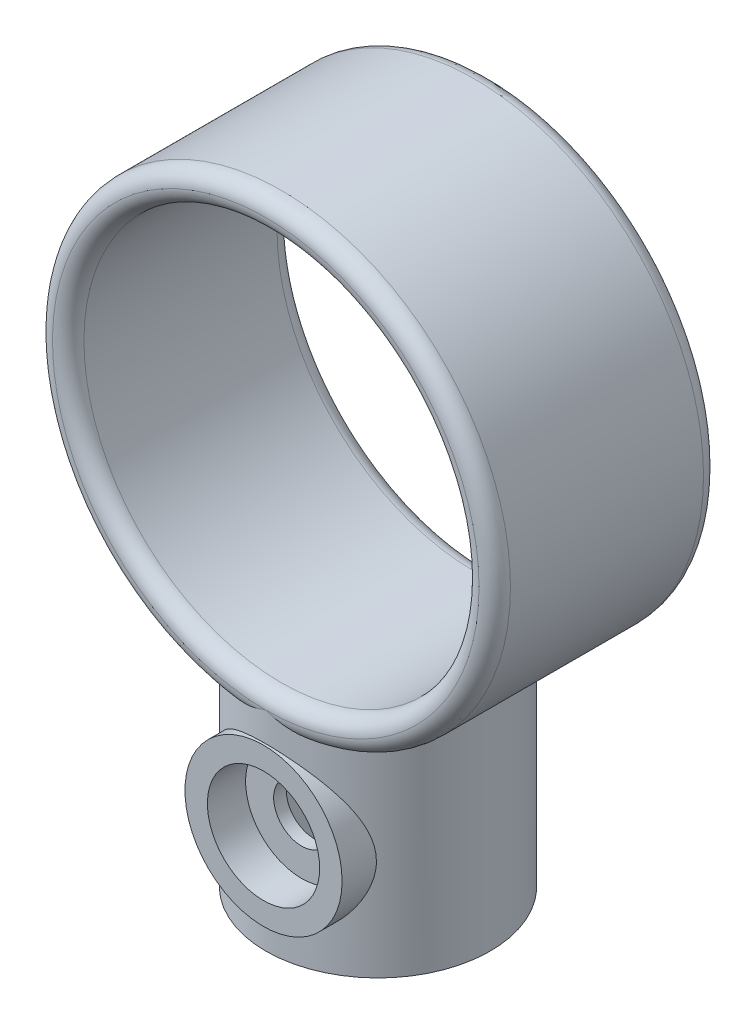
ISO-10303-21;
HEADER;
FILE_DESCRIPTION(('STEP AP214'),'2;1');
FILE_NAME('part.step','',(''),(''),'','','');
FILE_SCHEMA(('AUTOMOTIVE_DESIGN { 1 0 10303 214 1 1 1 1 }'));
ENDSEC;
DATA;
#1=APPLICATION_CONTEXT('core data for automotive mechanical design processes');
#2=APPLICATION_PROTOCOL_DEFINITION('international standard','automotive_design',2000,#1);
#3=PRODUCT_CONTEXT('',#1,'mechanical');
#4=PRODUCT('Part','Part','',(#3));
#5=PRODUCT_RELATED_PRODUCT_CATEGORY('part','',(#4));
#6=PRODUCT_DEFINITION_FORMATION('','',#4);
#7=PRODUCT_DEFINITION_CONTEXT('part definition',#1,'design');
#8=PRODUCT_DEFINITION('design','',#6,#7);
#9=PRODUCT_DEFINITION_SHAPE('','',#8);
#10=(LENGTH_UNIT() NAMED_UNIT(*) SI_UNIT(.MILLI.,.METRE.));
#11=(NAMED_UNIT(*) PLANE_ANGLE_UNIT() SI_UNIT($,.RADIAN.));
#12=(NAMED_UNIT(*) SI_UNIT($,.STERADIAN.) SOLID_ANGLE_UNIT());
#13=UNCERTAINTY_MEASURE_WITH_UNIT(LENGTH_MEASURE(1.E-05),#10,'distance_accuracy_value','');
#14=(GEOMETRIC_REPRESENTATION_CONTEXT(3) GLOBAL_UNCERTAINTY_ASSIGNED_CONTEXT((#13)) GLOBAL_UNIT_ASSIGNED_CONTEXT((#10,
#11,#12)) REPRESENTATION_CONTEXT('',''));
#15=CARTESIAN_POINT('',(0.,0.,0.));
#16=DIRECTION('',(0.,0.,1.));
#17=DIRECTION('',(1.,0.,0.));
#18=AXIS2_PLACEMENT_3D('',#15,#16,#17);
#19=CARTESIAN_POINT('',(-1.5875,-13.081,3.60275071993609));
#20=DIRECTION('',(0.,0.,-1.));
#21=DIRECTION('',(-1.,0.,0.));
#22=AXIS2_PLACEMENT_3D('',#19,#20,#21);
#23=PLANE('',#22);
#24=CARTESIAN_POINT('',(0.,-18.161,3.60275071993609));
#25=DIRECTION('',(0.,0.,-1.));
#26=DIRECTION('',(-1.,0.,0.));
#27=AXIS2_PLACEMENT_3D('',#24,#25,#26);
#28=CIRCLE('',#27,1.5875);
#29=CARTESIAN_POINT('',(1.5875,-18.161,3.60275071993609));
#30=VERTEX_POINT('',#29);
#31=CARTESIAN_POINT('',(-1.5875,-18.161,3.60275071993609));
#32=VERTEX_POINT('',#31);
#33=EDGE_CURVE('E47',#30,#32,#28,.F.);
#34=ORIENTED_EDGE('',*,*,#33,.T.);
#35=DIRECTION('',(0.,-1.,0.));
#36=VECTOR('',#35,1.);
#37=CARTESIAN_POINT('',(-1.5875,-13.081,3.60275071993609));
#38=LINE('',#37,#36);
#39=CARTESIAN_POINT('',(-1.5875,-13.081,3.60275071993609));
#40=VERTEX_POINT('',#39);
#41=EDGE_CURVE('E93',#40,#32,#38,.T.);
#42=ORIENTED_EDGE('',*,*,#41,.F.);
#43=DIRECTION('',(1.,0.,0.));
#44=VECTOR('',#43,1.);
#45=CARTESIAN_POINT('',(-1.5875,-13.081,3.60275071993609));
#46=LINE('',#45,#44);
#47=CARTESIAN_POINT('',(1.5875,-13.081,3.60275071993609));
#48=VERTEX_POINT('',#47);
#49=EDGE_CURVE('E315',#40,#48,#46,.T.);
#50=ORIENTED_EDGE('',*,*,#49,.T.);
#51=DIRECTION('',(0.,-1.,0.));
#52=VECTOR('',#51,1.);
#53=CARTESIAN_POINT('',(1.5875,-13.081,3.60275071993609));
#54=LINE('',#53,#52);
#55=EDGE_CURVE('E96',#48,#30,#54,.T.);
#56=ORIENTED_EDGE('',*,*,#55,.T.);
#57=EDGE_LOOP('',(#34,#42,#50,#56));
#58=FACE_BOUND('',#57,.T.);
#59=ADVANCED_FACE('F31',(#58),#23,.T.);
#60=CARTESIAN_POINT('',(0.,0.,6.35));
#61=DIRECTION('',(0.,0.,-1.));
#62=DIRECTION('',(-1.,0.,0.));
#63=AXIS2_PLACEMENT_3D('',#60,#61,#62);
#64=CYLINDRICAL_SURFACE('',#63,12.954);
#65=CARTESIAN_POINT('',(3.24036710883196,-12.5421743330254,5.461));
#66=CARTESIAN_POINT('',(3.39852522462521,-12.5013289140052,5.3671597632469));
#67=CARTESIAN_POINT('',(3.55217752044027,-12.4584249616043,5.26669390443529));
#68=CARTESIAN_POINT('',(3.84965096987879,-12.3697324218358,5.05333201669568));
#69=CARTESIAN_POINT('',(3.99347466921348,-12.3239445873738,4.94043922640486));
#70=CARTESIAN_POINT('',(4.27083010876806,-12.2306014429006,4.70275872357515));
#71=CARTESIAN_POINT('',(4.40434080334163,-12.1830427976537,4.57794779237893));
#72=CARTESIAN_POINT('',(4.66006458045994,-12.0875364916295,4.31736305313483));
#73=CARTESIAN_POINT('',(4.78227686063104,-12.0395888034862,4.18158846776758));
#74=CARTESIAN_POINT('',(5.01469040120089,-11.944653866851,3.89983668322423));
#75=CARTESIAN_POINT('',(5.12489323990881,-11.8976664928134,3.75386082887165));
#76=CARTESIAN_POINT('',(5.33259764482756,-11.8060325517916,3.45244782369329));
#77=CARTESIAN_POINT('',(5.43009998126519,-11.7613858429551,3.29701124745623));
#78=CARTESIAN_POINT('',(5.61163527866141,-11.6758611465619,2.97754710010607));
#79=CARTESIAN_POINT('',(5.69567354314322,-11.634981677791,2.81352294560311));
#80=CARTESIAN_POINT('',(5.84950609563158,-11.5584072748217,2.47786884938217));
#81=CARTESIAN_POINT('',(5.91930894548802,-11.5227092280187,2.30624355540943));
#82=CARTESIAN_POINT('',(6.04225375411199,-11.4587068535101,1.96119636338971));
#83=CARTESIAN_POINT('',(6.09579731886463,-11.4302277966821,1.78795037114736));
#84=CARTESIAN_POINT('',(6.18802378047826,-11.3805635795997,1.43660218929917));
#85=CARTESIAN_POINT('',(6.22671417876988,-11.3593747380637,1.2585024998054));
#86=CARTESIAN_POINT('',(6.28868651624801,-11.3251840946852,0.89898341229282));
#87=CARTESIAN_POINT('',(6.31197893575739,-11.3121767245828,0.717566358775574));
#88=CARTESIAN_POINT('',(6.3428187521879,-11.2949141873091,0.352992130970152));
#89=CARTESIAN_POINT('',(6.35036809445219,-11.2906579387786,0.169835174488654));
#90=CARTESIAN_POINT('',(6.34965030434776,-11.2910603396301,-0.174261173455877));
#91=CARTESIAN_POINT('',(6.34318530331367,-11.2947032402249,-0.335209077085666));
#92=CARTESIAN_POINT('',(6.31808188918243,-11.3087650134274,-0.655908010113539));
#93=CARTESIAN_POINT('',(6.29943960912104,-11.3191860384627,-0.815658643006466));
#94=CARTESIAN_POINT('',(6.25021818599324,-11.3464388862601,-1.13269687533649));
#95=CARTESIAN_POINT('',(6.21964262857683,-11.3632687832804,-1.28998519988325));
#96=CARTESIAN_POINT('',(6.14689582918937,-11.4027846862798,-1.60116103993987));
#97=CARTESIAN_POINT('',(6.10472002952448,-11.4254729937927,-1.75504719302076));
#98=CARTESIAN_POINT('',(6.00975901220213,-11.475703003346,-2.05669794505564));
#99=CARTESIAN_POINT('',(5.95710152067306,-11.5031858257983,-2.20451262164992));
#100=CARTESIAN_POINT('',(5.84134309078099,-11.5623982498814,-2.49513680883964));
#101=CARTESIAN_POINT('',(5.77823846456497,-11.5941293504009,-2.63794453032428));
#102=CARTESIAN_POINT('',(5.57389486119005,-11.694479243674,-3.05794933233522));
#103=CARTESIAN_POINT('',(5.41761476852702,-11.7682609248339,-3.32676388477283));
#104=CARTESIAN_POINT('',(5.04847190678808,-11.9316543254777,-3.86714840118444));
#105=CARTESIAN_POINT('',(4.83113561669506,-12.0221086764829,-4.1353828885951));
#106=CARTESIAN_POINT('',(4.35599693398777,-12.2022811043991,-4.63311734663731));
#107=CARTESIAN_POINT('',(4.09825242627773,-12.2920000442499,-4.8626717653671));
#108=CARTESIAN_POINT('',(3.72972717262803,-12.405838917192,-5.14055569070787));
#109=CARTESIAN_POINT('',(3.63446711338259,-12.4341060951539,-5.20834633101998));
#110=CARTESIAN_POINT('',(3.44020812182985,-12.4892450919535,-5.33864235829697));
#111=CARTESIAN_POINT('',(3.34121442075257,-12.5161187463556,-5.40115476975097));
#112=CARTESIAN_POINT('',(3.24036710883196,-12.5421743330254,-5.461));
#113=B_SPLINE_CURVE_WITH_KNOTS('',3,(#65,#66,#67,#68,#69,#70,#71,#72,#73,#74,#75,#76,#77,#78,
#79,#80,#81,#82,#83,#84,#85,#86,#87,#88,#89,#90,#91,#92,#93,#94,#95,#96,#97,#98,#99,#100,#101,
#102,#103,#104,#105,#106,#107,#108,#109,#110,#111,#112),.UNSPECIFIED.,.F.,.F.,(4,2,2,2,2,2,2,2,
2,2,2,2,2,2,2,2,2,2,2,2,2,2,2,4),(0.,0.564918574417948,1.12969026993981,1.69558560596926,
2.26152109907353,2.82738212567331,3.39320881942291,3.95881208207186,4.52407415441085,
5.07395790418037,5.623563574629,6.17279478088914,6.72195811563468,7.20471712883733,
7.68762951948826,8.17039691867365,8.65335426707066,9.1307517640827,9.60831814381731,
10.5633377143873,11.6297455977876,12.6946395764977,13.0553653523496,13.4156032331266),.UNSPECIFIED.);
#114=CARTESIAN_POINT('',(3.2403671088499,-12.5421743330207,5.461));
#115=VERTEX_POINT('',#114);
#116=CARTESIAN_POINT('',(3.24036710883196,-12.5421743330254,-5.461));
#117=VERTEX_POINT('',#116);
#118=EDGE_CURVE('E184',#115,#117,#113,.T.);
#119=ORIENTED_EDGE('',*,*,#118,.T.);
#120=CARTESIAN_POINT('',(0.,0.,-5.461));
#121=DIRECTION('',(0.,0.,1.));
#122=DIRECTION('',(1.,0.,0.));
#123=AXIS2_PLACEMENT_3D('',#120,#121,#122);
#124=CIRCLE('',#123,12.954);
#125=CARTESIAN_POINT('',(-3.2403671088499,-12.5421743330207,-5.461));
#126=VERTEX_POINT('',#125);
#127=EDGE_CURVE('E204',#117,#126,#124,.T.);
#128=ORIENTED_EDGE('',*,*,#127,.T.);
#129=CARTESIAN_POINT('',(-3.24036710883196,-12.5421743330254,-5.461));
#130=CARTESIAN_POINT('',(-3.39852522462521,-12.5013289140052,-5.3671597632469));
#131=CARTESIAN_POINT('',(-3.55217752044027,-12.4584249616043,-5.26669390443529));
#132=CARTESIAN_POINT('',(-3.84965096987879,-12.3697324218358,-5.05333201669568));
#133=CARTESIAN_POINT('',(-3.99347466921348,-12.3239445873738,-4.94043922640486));
#134=CARTESIAN_POINT('',(-4.27083010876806,-12.2306014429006,-4.70275872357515));
#135=CARTESIAN_POINT('',(-4.40434080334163,-12.1830427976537,-4.57794779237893));
#136=CARTESIAN_POINT('',(-4.66006458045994,-12.0875364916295,-4.31736305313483));
#137=CARTESIAN_POINT('',(-4.78227686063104,-12.0395888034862,-4.18158846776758));
#138=CARTESIAN_POINT('',(-5.01469040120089,-11.944653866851,-3.89983668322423));
#139=CARTESIAN_POINT('',(-5.12489323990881,-11.8976664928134,-3.75386082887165));
#140=CARTESIAN_POINT('',(-5.33259764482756,-11.8060325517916,-3.45244782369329));
#141=CARTESIAN_POINT('',(-5.43009998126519,-11.7613858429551,-3.29701124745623));
#142=CARTESIAN_POINT('',(-5.61163527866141,-11.6758611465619,-2.97754710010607));
#143=CARTESIAN_POINT('',(-5.69567354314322,-11.634981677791,-2.81352294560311));
#144=CARTESIAN_POINT('',(-5.84950609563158,-11.5584072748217,-2.47786884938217));
#145=CARTESIAN_POINT('',(-5.91930894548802,-11.5227092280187,-2.30624355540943));
#146=CARTESIAN_POINT('',(-6.04225375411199,-11.4587068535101,-1.96119636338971));
#147=CARTESIAN_POINT('',(-6.09579731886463,-11.4302277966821,-1.78795037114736));
#148=CARTESIAN_POINT('',(-6.18802378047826,-11.3805635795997,-1.43660218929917));
#149=CARTESIAN_POINT('',(-6.22671417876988,-11.3593747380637,-1.2585024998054));
#150=CARTESIAN_POINT('',(-6.28868651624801,-11.3251840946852,-0.898983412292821));
#151=CARTESIAN_POINT('',(-6.31197893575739,-11.3121767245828,-0.717566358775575));
#152=CARTESIAN_POINT('',(-6.3428187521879,-11.2949141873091,-0.352992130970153));
#153=CARTESIAN_POINT('',(-6.35036809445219,-11.2906579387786,-0.169835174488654));
#154=CARTESIAN_POINT('',(-6.34965030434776,-11.2910603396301,0.174261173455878));
#155=CARTESIAN_POINT('',(-6.34318530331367,-11.2947032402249,0.335209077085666));
#156=CARTESIAN_POINT('',(-6.31808188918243,-11.3087650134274,0.655908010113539));
#157=CARTESIAN_POINT('',(-6.29943960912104,-11.3191860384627,0.815658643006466));
#158=CARTESIAN_POINT('',(-6.25021818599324,-11.3464388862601,1.13269687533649));
#159=CARTESIAN_POINT('',(-6.21964262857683,-11.3632687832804,1.28998519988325));
#160=CARTESIAN_POINT('',(-6.14689582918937,-11.4027846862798,1.60116103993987));
#161=CARTESIAN_POINT('',(-6.10472002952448,-11.4254729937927,1.75504719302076));
#162=CARTESIAN_POINT('',(-6.00975901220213,-11.475703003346,2.05669794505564));
#163=CARTESIAN_POINT('',(-5.95710152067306,-11.5031858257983,2.20451262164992));
#164=CARTESIAN_POINT('',(-5.84134309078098,-11.5623982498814,2.49513680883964));
#165=CARTESIAN_POINT('',(-5.77823846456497,-11.5941293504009,2.63794453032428));
#166=CARTESIAN_POINT('',(-5.57389486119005,-11.694479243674,3.05794933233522));
#167=CARTESIAN_POINT('',(-5.41761476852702,-11.7682609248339,3.32676388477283));
#168=CARTESIAN_POINT('',(-5.04847190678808,-11.9316543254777,3.86714840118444));
#169=CARTESIAN_POINT('',(-4.83113561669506,-12.0221086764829,4.1353828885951));
#170=CARTESIAN_POINT('',(-4.35599693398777,-12.2022811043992,4.63311734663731));
#171=CARTESIAN_POINT('',(-4.09825242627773,-12.2920000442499,4.8626717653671));
#172=CARTESIAN_POINT('',(-3.72972717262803,-12.405838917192,5.14055569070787));
#173=CARTESIAN_POINT('',(-3.63446711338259,-12.4341060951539,5.20834633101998));
#174=CARTESIAN_POINT('',(-3.44020812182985,-12.4892450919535,5.33864235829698));
#175=CARTESIAN_POINT('',(-3.34121442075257,-12.5161187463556,5.40115476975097));
#176=CARTESIAN_POINT('',(-3.24036710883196,-12.5421743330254,5.461));
#177=B_SPLINE_CURVE_WITH_KNOTS('',3,(#129,#130,#131,#132,#133,#134,#135,#136,#137,#138,#139,
#140,#141,#142,#143,#144,#145,#146,#147,#148,#149,#150,#151,#152,#153,#154,#155,#156,#157,#158,
#159,#160,#161,#162,#163,#164,#165,#166,#167,#168,#169,#170,#171,#172,#173,#174,#175,#176),
.UNSPECIFIED.,.F.,.F.,(4,2,2,2,2,2,2,2,2,2,2,2,2,2,2,2,2,2,2,2,2,2,2,4),(0.,0.564918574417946,
1.12969026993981,1.69558560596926,2.26152109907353,2.8273821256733,3.39320881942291,
3.95881208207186,4.52407415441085,5.07395790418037,5.623563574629,6.17279478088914,
6.72195811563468,7.20471712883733,7.68762951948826,8.17039691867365,8.65335426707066,
9.13075176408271,9.60831814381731,10.5633377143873,11.6297455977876,12.6946395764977,
13.0553653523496,13.4156032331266),.UNSPECIFIED.);
#178=CARTESIAN_POINT('',(-3.24036710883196,-12.5421743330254,5.461));
#179=VERTEX_POINT('',#178);
#180=EDGE_CURVE('E179',#126,#179,#177,.T.);
#181=ORIENTED_EDGE('',*,*,#180,.T.);
#182=CARTESIAN_POINT('',(0.,0.,5.461));
#183=DIRECTION('',(0.,0.,1.));
#184=DIRECTION('',(1.,0.,0.));
#185=AXIS2_PLACEMENT_3D('',#182,#183,#184);
#186=CIRCLE('',#185,12.954);
#187=EDGE_CURVE('E206',#179,#115,#186,.F.);
#188=ORIENTED_EDGE('',*,*,#187,.T.);
#189=EDGE_LOOP('',(#119,#128,#181,#188));
#190=FACE_BOUND('',#189,.T.);
#191=ADVANCED_FACE('F139',(#190),#64,.T.);
#192=CARTESIAN_POINT('',(0.,0.,5.461));
#193=DIRECTION('',(0.,0.,1.));
#194=DIRECTION('',(1.,0.,0.));
#195=AXIS2_PLACEMENT_3D('',#192,#193,#194);
#196=TOROIDAL_SURFACE('',#195,12.065,0.889);
#197=ORIENTED_EDGE('',*,*,#187,.F.);
#198=CARTESIAN_POINT('',(0.,-12.065,6.35));
#199=CARTESIAN_POINT('',(-0.00497535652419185,-12.0668615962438,6.35000001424));
#200=CARTESIAN_POINT('',(-0.00995194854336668,-12.068720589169,6.34999416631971));
#201=CARTESIAN_POINT('',(-0.296736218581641,-12.1756700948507,6.34931910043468));
#202=CARTESIAN_POINT('',(-0.582450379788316,-12.2723203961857,6.32984437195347));
#203=CARTESIAN_POINT('',(-1.01285060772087,-12.3963130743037,6.27038446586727));
#204=CARTESIAN_POINT('',(-1.15681642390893,-12.434183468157,6.24546940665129));
#205=CARTESIAN_POINT('',(-1.44454418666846,-12.5012536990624,6.18525555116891));
#206=CARTESIAN_POINT('',(-1.58830620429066,-12.5304588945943,6.14996319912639));
#207=CARTESIAN_POINT('',(-1.92240732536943,-12.5862776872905,6.05525190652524));
#208=CARTESIAN_POINT('',(-2.11234825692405,-12.6088046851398,5.99171278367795));
#209=CARTESIAN_POINT('',(-2.39250236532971,-12.624261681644,5.88289663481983));
#210=CARTESIAN_POINT('',(-2.4849429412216,-12.6263701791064,5.84444916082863));
#211=CARTESIAN_POINT('',(-2.66780644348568,-12.623683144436,5.76327127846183));
#212=CARTESIAN_POINT('',(-2.75823039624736,-12.6188912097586,5.7205431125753));
#213=CARTESIAN_POINT('',(-2.92770043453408,-12.6023353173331,5.63552523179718));
#214=CARTESIAN_POINT('',(-3.00699715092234,-12.5912955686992,5.59359783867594));
#215=CARTESIAN_POINT('',(-3.16293951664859,-12.5620498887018,5.50693736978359));
#216=CARTESIAN_POINT('',(-3.23957795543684,-12.5438259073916,5.46219746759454));
#217=CARTESIAN_POINT('',(-3.31446114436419,-12.5216371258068,5.41635));
#218=B_SPLINE_CURVE_WITH_KNOTS('',3,(#198,#199,#200,#201,#202,#203,#204,#205,#206,#207,#208,
#209,#210,#211,#212,#213,#214,#215,#216,#217),.UNSPECIFIED.,.F.,.F.,(4,2,2,2,2,2,2,2,2,4),(0.,
0.0159373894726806,0.918193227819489,1.37053566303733,1.82259778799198,2.42488996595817,
2.72502983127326,3.02501327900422,3.29579070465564,3.56725282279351),.UNSPECIFIED.);
#219=CARTESIAN_POINT('',(0.,-12.065,6.35));
#220=VERTEX_POINT('',#219);
#221=EDGE_CURVE('E110',#220,#179,#218,.T.);
#222=ORIENTED_EDGE('',*,*,#221,.F.);
#223=CARTESIAN_POINT('',(0.,0.,6.35));
#224=DIRECTION('',(0.,0.,1.));
#225=DIRECTION('',(1.,0.,0.));
#226=AXIS2_PLACEMENT_3D('',#223,#224,#225);
#227=CIRCLE('',#226,12.065);
#228=EDGE_CURVE('E207',#220,#220,#227,.F.);
#229=ORIENTED_EDGE('',*,*,#228,.T.);
#230=CARTESIAN_POINT('',(3.31446114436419,-12.5216371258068,5.41635));
#231=CARTESIAN_POINT('',(3.25206078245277,-12.5401315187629,5.45454337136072));
#232=CARTESIAN_POINT('',(3.18844875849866,-12.5558662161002,5.49197821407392));
#233=CARTESIAN_POINT('',(3.05923174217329,-12.5822555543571,5.56498739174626));
#234=CARTESIAN_POINT('',(2.99362914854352,-12.5929160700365,5.60056383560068));
#235=CARTESIAN_POINT('',(2.79501095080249,-12.6179029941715,5.70373104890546));
#236=CARTESIAN_POINT('',(2.65947031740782,-12.6254335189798,5.76819873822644));
#237=CARTESIAN_POINT('',(2.41404109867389,-12.6254123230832,5.87441691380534));
#238=CARTESIAN_POINT('',(2.30492949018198,-12.6207648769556,5.91806744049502));
#239=CARTESIAN_POINT('',(2.08499401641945,-12.6034977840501,5.99908706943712));
#240=CARTESIAN_POINT('',(1.97416945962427,-12.5908748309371,6.0364535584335));
#241=CARTESIAN_POINT('',(1.6396542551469,-12.5426765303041,6.13908980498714));
#242=CARTESIAN_POINT('',(1.41438143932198,-12.4967816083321,6.19469877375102));
#243=CARTESIAN_POINT('',(1.05293543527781,-12.4070533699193,6.26364453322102));
#244=CARTESIAN_POINT('',(0.916534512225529,-12.369496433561,6.2850056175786));
#245=CARTESIAN_POINT('',(0.644628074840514,-12.2883959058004,6.31867525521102));
#246=CARTESIAN_POINT('',(0.509121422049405,-12.244862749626,6.33099935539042));
#247=CARTESIAN_POINT('',(0.253932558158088,-12.1579300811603,6.34606505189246));
#248=CARTESIAN_POINT('',(0.134130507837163,-12.1150298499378,6.34970222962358));
#249=CARTESIAN_POINT('',(0.00995212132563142,-12.0687206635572,6.34999415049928));
#250=CARTESIAN_POINT('',(0.00497553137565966,-12.066861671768,6.3499999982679));
#251=CARTESIAN_POINT('',(0.,-12.065,6.35));
#252=B_SPLINE_CURVE_WITH_KNOTS('',3,(#230,#231,#232,#233,#234,#235,#236,#237,#238,#239,#240,
#241,#242,#243,#244,#245,#246,#247,#248,#249,#250,#251),.UNSPECIFIED.,.F.,.F.,(4,2,2,2,2,2,2,2,
2,2,4),(0.,0.226227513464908,0.452192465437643,0.901561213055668,1.25394783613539,
1.60648064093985,2.31302856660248,2.74194125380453,3.17011431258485,3.55177094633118,
3.56770833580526),.UNSPECIFIED.);
#253=EDGE_CURVE('E109',#115,#220,#252,.T.);
#254=ORIENTED_EDGE('',*,*,#253,.F.);
#255=EDGE_LOOP('',(#197,#222,#229,#254));
#256=FACE_BOUND('',#255,.T.);
#257=ADVANCED_FACE('F142',(#256),#196,.T.);
#258=CARTESIAN_POINT('',(0.,0.,-5.461));
#259=DIRECTION('',(0.,0.,1.));
#260=DIRECTION('',(1.,0.,0.));
#261=AXIS2_PLACEMENT_3D('',#258,#259,#260);
#262=TOROIDAL_SURFACE('',#261,12.065,0.889);
#263=ORIENTED_EDGE('',*,*,#127,.F.);
#264=CARTESIAN_POINT('',(0.,-12.065,-6.35));
#265=CARTESIAN_POINT('',(0.00497535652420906,-12.0668615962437,-6.35000001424));
#266=CARTESIAN_POINT('',(0.00995194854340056,-12.068720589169,-6.34999416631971));
#267=CARTESIAN_POINT('',(0.296736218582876,-12.1756700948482,-6.34931910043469));
#268=CARTESIAN_POINT('',(0.582450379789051,-12.2723203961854,-6.32984437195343));
#269=CARTESIAN_POINT('',(1.01285060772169,-12.3963130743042,-6.27038446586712));
#270=CARTESIAN_POINT('',(1.15681642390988,-12.4341834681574,-6.24546940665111));
#271=CARTESIAN_POINT('',(1.44454418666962,-12.5012536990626,-6.18525555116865));
#272=CARTESIAN_POINT('',(1.5883062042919,-12.5304588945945,-6.14996319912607));
#273=CARTESIAN_POINT('',(1.92240732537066,-12.5862776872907,-6.05525190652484));
#274=CARTESIAN_POINT('',(2.11234825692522,-12.6088046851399,-5.99171278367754));
#275=CARTESIAN_POINT('',(2.39250236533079,-12.6242616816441,-5.88289663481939));
#276=CARTESIAN_POINT('',(2.48494294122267,-12.6263701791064,-5.84444916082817));
#277=CARTESIAN_POINT('',(2.66780644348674,-12.6236831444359,-5.76327127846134));
#278=CARTESIAN_POINT('',(2.7582303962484,-12.6188912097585,-5.7205431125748));
#279=CARTESIAN_POINT('',(2.92770043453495,-12.6023353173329,-5.63552523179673));
#280=CARTESIAN_POINT('',(3.00699715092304,-12.5912955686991,-5.59359783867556));
#281=CARTESIAN_POINT('',(3.16293951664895,-12.5620498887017,-5.50693736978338));
#282=CARTESIAN_POINT('',(3.23957795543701,-12.5438259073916,-5.46219746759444));
#283=CARTESIAN_POINT('',(3.31446114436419,-12.5216371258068,-5.41635));
#284=B_SPLINE_CURVE_WITH_KNOTS('',3,(#264,#265,#266,#267,#268,#269,#270,#271,#272,#273,#274,
#275,#276,#277,#278,#279,#280,#281,#282,#283),.UNSPECIFIED.,.F.,.F.,(4,2,2,2,2,2,2,2,2,4),(0.,
0.0159373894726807,0.918193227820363,1.37053566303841,1.82259778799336,2.42488996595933,
2.72502983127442,3.02501327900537,3.29579070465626,3.5672528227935),.UNSPECIFIED.);
#285=CARTESIAN_POINT('',(0.,-12.065,-6.35));
#286=VERTEX_POINT('',#285);
#287=EDGE_CURVE('E194',#286,#117,#284,.T.);
#288=ORIENTED_EDGE('',*,*,#287,.F.);
#289=CARTESIAN_POINT('',(0.,0.,-6.35));
#290=DIRECTION('',(0.,0.,1.));
#291=DIRECTION('',(1.,0.,0.));
#292=AXIS2_PLACEMENT_3D('',#289,#290,#291);
#293=CIRCLE('',#292,12.065);
#294=EDGE_CURVE('E35',#286,#286,#293,.T.);
#295=ORIENTED_EDGE('',*,*,#294,.T.);
#296=CARTESIAN_POINT('',(-3.31446114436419,-12.5216371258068,-5.41635));
#297=CARTESIAN_POINT('',(-3.25204230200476,-12.5401369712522,-5.45455468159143));
#298=CARTESIAN_POINT('',(-3.18841113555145,-12.555875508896,-5.49200035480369));
#299=CARTESIAN_POINT('',(-3.05915518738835,-12.5822695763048,-5.56502976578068));
#300=CARTESIAN_POINT('',(-2.99353281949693,-12.5929310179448,-5.60061562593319));
#301=CARTESIAN_POINT('',(-2.79493116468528,-12.6179074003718,-5.70376901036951));
#302=CARTESIAN_POINT('',(-2.65942951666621,-12.6254334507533,-5.76821632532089));
#303=CARTESIAN_POINT('',(-2.41408717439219,-12.6254123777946,-5.87439702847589));
#304=CARTESIAN_POINT('',(-2.3050230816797,-12.6207689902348,-5.9180301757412));
#305=CARTESIAN_POINT('',(-2.08518281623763,-12.6035158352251,-5.99902030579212));
#306=CARTESIAN_POINT('',(-1.97440598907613,-12.5909029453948,-6.0363748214));
#307=CARTESIAN_POINT('',(-1.63985761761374,-12.5427178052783,-6.13903971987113));
#308=CARTESIAN_POINT('',(-1.41452016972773,-12.4968130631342,-6.19467103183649));
#309=CARTESIAN_POINT('',(-0.992117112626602,-12.3919579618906,-6.275246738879));
#310=CARTESIAN_POINT('',(-0.79498531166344,-12.3353086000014,-6.30312530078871));
#311=CARTESIAN_POINT('',(-0.402991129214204,-12.2106297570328,-6.3402465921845));
#312=CARTESIAN_POINT('',(-0.20812487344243,-12.1426242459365,-6.34952805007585));
#313=CARTESIAN_POINT('',(-0.00995205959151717,-12.0687206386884,-6.34999415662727));
#314=CARTESIAN_POINT('',(-0.00497546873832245,-12.0668616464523,-6.35000000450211));
#315=CARTESIAN_POINT('',(0.,-12.065,-6.35));
#316=B_SPLINE_CURVE_WITH_KNOTS('',3,(#296,#297,#298,#299,#300,#301,#302,#303,#304,#305,#306,
#307,#308,#309,#310,#311,#312,#313,#314,#315),.UNSPECIFIED.,.F.,.F.,(4,2,2,2,2,2,2,2,2,4),(0.,
0.226294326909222,0.452324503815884,0.901561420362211,1.25379866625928,1.60617400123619,
2.31302816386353,2.93288428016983,3.55144820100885,3.56738559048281),.UNSPECIFIED.);
#317=EDGE_CURVE('E198',#126,#286,#316,.T.);
#318=ORIENTED_EDGE('',*,*,#317,.F.);
#319=EDGE_LOOP('',(#263,#288,#295,#318));
#320=FACE_BOUND('',#319,.T.);
#321=ADVANCED_FACE('F137',(#320),#262,.T.);
#322=CARTESIAN_POINT('',(0.,0.,6.35));
#323=DIRECTION('',(0.,0.,-1.));
#324=DIRECTION('',(-1.,0.,0.));
#325=AXIS2_PLACEMENT_3D('',#322,#323,#324);
#326=CYLINDRICAL_SURFACE('',#325,11.176);
#327=CARTESIAN_POINT('',(0.,0.,5.461));
#328=DIRECTION('',(0.,0.,1.));
#329=DIRECTION('',(1.,0.,0.));
#330=AXIS2_PLACEMENT_3D('',#327,#328,#329);
#331=CIRCLE('',#330,11.176);
#332=CARTESIAN_POINT('',(11.176,0.,5.461));
#333=VERTEX_POINT('',#332);
#334=EDGE_CURVE('E11',#333,#333,#331,.T.);
#335=ORIENTED_EDGE('',*,*,#334,.T.);
#336=EDGE_LOOP('',(#335));
#337=FACE_BOUND('',#336,.T.);
#338=CARTESIAN_POINT('',(0.,0.,-5.461));
#339=DIRECTION('',(0.,0.,1.));
#340=DIRECTION('',(1.,0.,0.));
#341=AXIS2_PLACEMENT_3D('',#338,#339,#340);
#342=CIRCLE('',#341,11.176);
#343=CARTESIAN_POINT('',(11.176,0.,-5.461));
#344=VERTEX_POINT('',#343);
#345=EDGE_CURVE('E40',#344,#344,#342,.F.);
#346=ORIENTED_EDGE('',*,*,#345,.T.);
#347=EDGE_LOOP('',(#346));
#348=FACE_BOUND('',#347,.T.);
#349=ADVANCED_FACE('F132',(#337,#348),#326,.F.);
#350=CARTESIAN_POINT('',(0.,0.,5.461));
#351=DIRECTION('',(0.,0.,1.));
#352=DIRECTION('',(1.,0.,0.));
#353=AXIS2_PLACEMENT_3D('',#350,#351,#352);
#354=TOROIDAL_SURFACE('',#353,12.065,0.889);
#355=ORIENTED_EDGE('',*,*,#334,.F.);
#356=EDGE_LOOP('',(#355));
#357=FACE_BOUND('',#356,.T.);
#358=ORIENTED_EDGE('',*,*,#228,.F.);
#359=EDGE_LOOP('',(#358));
#360=FACE_BOUND('',#359,.T.);
#361=ADVANCED_FACE('F136',(#357,#360),#354,.T.);
#362=CARTESIAN_POINT('',(0.,0.,-5.461));
#363=DIRECTION('',(0.,0.,1.));
#364=DIRECTION('',(1.,0.,0.));
#365=AXIS2_PLACEMENT_3D('',#362,#363,#364);
#366=TOROIDAL_SURFACE('',#365,12.065,0.889);
#367=ORIENTED_EDGE('',*,*,#345,.F.);
#368=EDGE_LOOP('',(#367));
#369=FACE_BOUND('',#368,.T.);
#370=ORIENTED_EDGE('',*,*,#294,.F.);
#371=EDGE_LOOP('',(#370));
#372=FACE_BOUND('',#371,.T.);
#373=ADVANCED_FACE('F33',(#369,#372),#366,.T.);
#374=CARTESIAN_POINT('',(0.,-23.876,0.));
#375=DIRECTION('',(0.,1.,0.));
#376=DIRECTION('',(0.,0.,1.));
#377=AXIS2_PLACEMENT_3D('',#374,#375,#376);
#378=PLANE('',#377);
#379=DIRECTION('',(1.,0.,0.));
#380=VECTOR('',#379,1.);
#381=CARTESIAN_POINT('',(-1.5875,-23.876,3.60275071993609));
#382=LINE('',#381,#380);
#383=CARTESIAN_POINT('',(-1.5875,-23.876,3.60275071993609));
#384=VERTEX_POINT('',#383);
#385=CARTESIAN_POINT('',(1.5875,-23.876,3.60275071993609));
#386=VERTEX_POINT('',#385);
#387=EDGE_CURVE('E101',#384,#386,#382,.T.);
#388=ORIENTED_EDGE('',*,*,#387,.T.);
#389=CARTESIAN_POINT('',(0.,-23.876,0.));
#390=DIRECTION('',(0.,-1.,0.));
#391=DIRECTION('',(0.,0.,-1.));
#392=AXIS2_PLACEMENT_3D('',#389,#390,#391);
#393=CIRCLE('',#392,3.937);
#394=EDGE_CURVE('E310',#384,#386,#393,.T.);
#395=ORIENTED_EDGE('',*,*,#394,.F.);
#396=EDGE_LOOP('',(#388,#395));
#397=FACE_BOUND('',#396,.T.);
#398=CARTESIAN_POINT('',(0.,-23.876,0.));
#399=DIRECTION('',(0.,1.,0.));
#400=DIRECTION('',(0.,0.,1.));
#401=AXIS2_PLACEMENT_3D('',#398,#399,#400);
#402=CIRCLE('',#401,6.35);
#403=CARTESIAN_POINT('',(0.,-23.876,6.35));
#404=VERTEX_POINT('',#403);
#405=EDGE_CURVE('E189',#404,#404,#402,.T.);
#406=ORIENTED_EDGE('',*,*,#405,.F.);
#407=EDGE_LOOP('',(#406));
#408=FACE_BOUND('',#407,.T.);
#409=ADVANCED_FACE('F171',(#397,#408),#378,.F.);
#410=CARTESIAN_POINT('',(0.,12.955,0.));
#411=DIRECTION('',(0.,-1.,0.));
#412=DIRECTION('',(0.,0.,-1.));
#413=AXIS2_PLACEMENT_3D('',#410,#411,#412);
#414=CYLINDRICAL_SURFACE('',#413,6.35);
#415=CARTESIAN_POINT('',(4.445,-18.161,4.53480705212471));
#416=CARTESIAN_POINT('',(4.44499937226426,-18.0543062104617,4.53480817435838));
#417=CARTESIAN_POINT('',(4.44114970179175,-17.947604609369,4.5385908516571));
#418=CARTESIAN_POINT('',(4.42584625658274,-17.7352688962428,4.55351466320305));
#419=CARTESIAN_POINT('',(4.41439151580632,-17.6296349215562,4.56465673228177));
#420=CARTESIAN_POINT('',(4.38411489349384,-17.4202074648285,4.59374296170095));
#421=CARTESIAN_POINT('',(4.36528078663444,-17.3164173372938,4.61169840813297));
#422=CARTESIAN_POINT('',(4.32061506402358,-17.111562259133,4.6535707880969));
#423=CARTESIAN_POINT('',(4.29477965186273,-17.0104988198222,4.67749095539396));
#424=CARTESIAN_POINT('',(4.20805864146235,-16.7145755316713,4.75612989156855));
#425=CARTESIAN_POINT('',(4.1375658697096,-16.5243845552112,4.81813098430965));
#426=CARTESIAN_POINT('',(3.97374457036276,-16.1591071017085,4.95410739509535));
#427=CARTESIAN_POINT('',(3.88041445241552,-15.9840216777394,5.0280835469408));
#428=CARTESIAN_POINT('',(3.65450412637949,-15.6201107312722,5.19519851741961));
#429=CARTESIAN_POINT('',(3.51791257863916,-15.4342485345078,5.28942445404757));
#430=CARTESIAN_POINT('',(3.29274248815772,-15.1728362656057,5.43030880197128));
#431=CARTESIAN_POINT('',(3.21422605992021,-15.0885281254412,5.47723622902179));
#432=CARTESIAN_POINT('',(3.05053180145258,-14.9259439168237,5.57006248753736));
#433=CARTESIAN_POINT('',(2.96535249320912,-14.847669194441,5.61596108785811));
#434=CARTESIAN_POINT('',(2.77375715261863,-14.6849938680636,5.71333259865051));
#435=CARTESIAN_POINT('',(2.66617104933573,-14.6017557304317,5.76445514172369));
#436=CARTESIAN_POINT('',(2.44262247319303,-14.4447835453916,5.86267815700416));
#437=CARTESIAN_POINT('',(2.32666380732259,-14.3710452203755,5.90978043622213));
#438=CARTESIAN_POINT('',(2.08698830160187,-14.2339751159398,5.99860631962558));
#439=CARTESIAN_POINT('',(1.96328183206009,-14.1706298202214,6.04033689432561));
#440=CARTESIAN_POINT('',(1.70883584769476,-14.05521975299,6.11719376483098));
#441=CARTESIAN_POINT('',(1.57809942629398,-14.0031500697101,6.15232293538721));
#442=CARTESIAN_POINT('',(1.24886776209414,-13.8900579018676,6.22920254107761));
#443=CARTESIAN_POINT('',(1.04687520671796,-13.8359409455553,6.26656155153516));
#444=CARTESIAN_POINT('',(0.634826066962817,-13.756569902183,6.32160276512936));
#445=CARTESIAN_POINT('',(0.424776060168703,-13.731292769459,6.33930067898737));
#446=CARTESIAN_POINT('',(0.00205416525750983,-13.7109597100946,6.35352469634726));
#447=CARTESIAN_POINT('',(-0.210622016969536,-13.7159624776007,6.35000968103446));
#448=CARTESIAN_POINT('',(-0.631721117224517,-13.7560342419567,6.32202480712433));
#449=CARTESIAN_POINT('',(-0.840142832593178,-13.7911116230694,6.29754910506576));
#450=CARTESIAN_POINT('',(-1.24229246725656,-13.8882276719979,6.23055861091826));
#451=CARTESIAN_POINT('',(-1.43624715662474,-13.9496328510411,6.18846819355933));
#452=CARTESIAN_POINT('',(-1.81067974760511,-14.0965248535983,6.08945775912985));
#453=CARTESIAN_POINT('',(-1.99115499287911,-14.1820164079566,6.03253482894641));
#454=CARTESIAN_POINT('',(-2.35550833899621,-14.3850424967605,5.90048404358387));
#455=CARTESIAN_POINT('',(-2.53749482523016,-14.5050965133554,5.82402997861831));
#456=CARTESIAN_POINT('',(-2.87985061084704,-14.7681824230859,5.66258695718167));
#457=CARTESIAN_POINT('',(-3.04019628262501,-14.9112390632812,5.57758884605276));
#458=CARTESIAN_POINT('',(-3.3646833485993,-15.2454486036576,5.38910708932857));
#459=CARTESIAN_POINT('',(-3.52438847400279,-15.4406283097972,5.28503307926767));
#460=CARTESIAN_POINT('',(-3.73833974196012,-15.7529392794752,5.13371333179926));
#461=CARTESIAN_POINT('',(-3.80540844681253,-15.860341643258,5.08405510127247));
#462=CARTESIAN_POINT('',(-3.9306445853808,-16.0815232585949,4.98786048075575));
#463=CARTESIAN_POINT('',(-3.98881360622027,-16.1953013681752,4.94132353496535));
#464=CARTESIAN_POINT('',(-4.12441481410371,-16.4918230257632,4.82939292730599));
#465=CARTESIAN_POINT('',(-4.195479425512,-16.6788675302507,4.76724819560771));
#466=CARTESIAN_POINT('',(-4.28328877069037,-16.968667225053,4.68801648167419));
#467=CARTESIAN_POINT('',(-4.309421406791,-17.0667698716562,4.66394281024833));
#468=CARTESIAN_POINT('',(-4.35508801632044,-17.2656632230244,4.62132920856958));
#469=CARTESIAN_POINT('',(-4.37462524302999,-17.3664525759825,4.60278655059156));
#470=CARTESIAN_POINT('',(-4.40692541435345,-17.5711814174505,4.57187247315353));
#471=CARTESIAN_POINT('',(-4.41961400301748,-17.6751430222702,4.55956887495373));
#472=CARTESIAN_POINT('',(-4.43762088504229,-17.8843019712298,4.542045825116));
#473=CARTESIAN_POINT('',(-4.44293944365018,-17.9894992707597,4.5368261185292));
#474=CARTESIAN_POINT('',(-4.44607439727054,-18.200088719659,4.53375450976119));
#475=CARTESIAN_POINT('',(-4.44389302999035,-18.3054808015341,4.53590040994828));
#476=CARTESIAN_POINT('',(-4.43209711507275,-18.5154169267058,4.54742491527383));
#477=CARTESIAN_POINT('',(-4.42248288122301,-18.6199610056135,4.55680321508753));
#478=CARTESIAN_POINT('',(-4.38647618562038,-18.9020129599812,4.59155489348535));
#479=CARTESIAN_POINT('',(-4.35298747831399,-19.0778606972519,4.62358296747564));
#480=CARTESIAN_POINT('',(-4.26642994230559,-19.4207751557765,4.70356253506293));
#481=CARTESIAN_POINT('',(-4.21334047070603,-19.5878324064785,4.75153081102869));
#482=CARTESIAN_POINT('',(-4.06024843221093,-19.9878539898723,4.88377603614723));
#483=CARTESIAN_POINT('',(-3.9499274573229,-20.2147933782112,4.97451235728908));
#484=CARTESIAN_POINT('',(-3.75917535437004,-20.5363386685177,5.1183519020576));
#485=CARTESIAN_POINT('',(-3.69126733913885,-20.6405082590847,5.16766164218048));
#486=CARTESIAN_POINT('',(-3.54730037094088,-20.8424255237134,5.26752582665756));
#487=CARTESIAN_POINT('',(-3.47124236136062,-20.9401739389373,5.31808012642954));
#488=CARTESIAN_POINT('',(-3.22822410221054,-21.2269740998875,5.47157669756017));
#489=CARTESIAN_POINT('',(-3.0487416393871,-21.4056701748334,5.57451767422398));
#490=CARTESIAN_POINT('',(-2.65915223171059,-21.7319037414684,5.7705229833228));
#491=CARTESIAN_POINT('',(-2.44909096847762,-21.8794869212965,5.86360169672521));
#492=CARTESIAN_POINT('',(-2.03697587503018,-22.1177390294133,6.01775884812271));
#493=CARTESIAN_POINT('',(-1.83908252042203,-22.213746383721,6.08157679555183));
#494=CARTESIAN_POINT('',(-1.53014216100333,-22.3358047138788,6.16381241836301));
#495=CARTESIAN_POINT('',(-1.42511517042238,-22.3728391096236,6.18898074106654));
#496=CARTESIAN_POINT('',(-1.21160233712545,-22.43914444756,6.23429261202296));
#497=CARTESIAN_POINT('',(-1.10311801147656,-22.4684187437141,6.25443833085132));
#498=CARTESIAN_POINT('',(-0.882708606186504,-22.5189487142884,6.28934471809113));
#499=CARTESIAN_POINT('',(-0.770766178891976,-22.5401528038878,6.30407072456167));
#500=CARTESIAN_POINT('',(-0.545015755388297,-22.5739355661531,6.32758466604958));
#501=CARTESIAN_POINT('',(-0.431208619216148,-22.5865181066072,6.33637526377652));
#502=CARTESIAN_POINT('',(-0.202662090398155,-22.6028551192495,6.34779628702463));
#503=CARTESIAN_POINT('',(-0.0879227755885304,-22.6066103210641,6.35042722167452));
#504=CARTESIAN_POINT('',(0.141469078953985,-22.6052284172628,6.34945989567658));
#505=CARTESIAN_POINT('',(0.256121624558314,-22.6000919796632,6.3458621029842));
#506=CARTESIAN_POINT('',(0.473258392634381,-22.5819434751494,6.33318075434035));
#507=CARTESIAN_POINT('',(0.57584457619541,-22.5697433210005,6.3246629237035));
#508=CARTESIAN_POINT('',(0.779430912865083,-22.5383438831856,6.30281617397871));
#509=CARTESIAN_POINT('',(0.880430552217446,-22.5191423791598,6.28948572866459));
#510=CARTESIAN_POINT('',(1.18000332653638,-22.4513882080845,6.24266016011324));
#511=CARTESIAN_POINT('',(1.37532485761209,-22.3926707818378,6.20231996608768));
#512=CARTESIAN_POINT('',(1.75931162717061,-22.2483562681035,6.10475557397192));
#513=CARTESIAN_POINT('',(1.94750439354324,-22.1618900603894,6.04698969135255));
#514=CARTESIAN_POINT('',(2.30692333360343,-21.9660016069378,5.91920622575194));
#515=CARTESIAN_POINT('',(2.47814621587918,-21.8565749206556,5.84918627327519));
#516=CARTESIAN_POINT('',(2.82728501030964,-21.598832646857,5.68958211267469));
#517=CARTESIAN_POINT('',(3.00206037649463,-21.4471116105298,5.59865076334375));
#518=CARTESIAN_POINT('',(3.32551437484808,-21.119397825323,5.41278864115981));
#519=CARTESIAN_POINT('',(3.47413723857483,-20.9433546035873,5.31784984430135));
#520=CARTESIAN_POINT('',(3.68654238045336,-20.6480089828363,5.17116088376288));
#521=CARTESIAN_POINT('',(3.75970536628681,-20.5360096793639,5.11805089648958));
#522=CARTESIAN_POINT('',(3.89621323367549,-20.3047302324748,5.01491068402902));
#523=CARTESIAN_POINT('',(3.95955534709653,-20.1854480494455,4.96488132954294));
#524=CARTESIAN_POINT('',(4.0756128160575,-19.9402570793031,4.87006008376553));
#525=CARTESIAN_POINT('',(4.12835637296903,-19.8143670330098,4.82525443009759));
#526=CARTESIAN_POINT('',(4.22262742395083,-19.5561030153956,4.74297788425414));
#527=CARTESIAN_POINT('',(4.26415773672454,-19.4237306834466,4.70550514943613));
#528=CARTESIAN_POINT('',(4.32331466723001,-19.1981705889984,4.65107391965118));
#529=CARTESIAN_POINT('',(4.34430437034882,-19.1065011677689,4.63142948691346));
#530=CARTESIAN_POINT('',(4.38054261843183,-18.9211204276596,4.597169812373));
#531=CARTESIAN_POINT('',(4.39579299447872,-18.8274097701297,4.58255296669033));
#532=CARTESIAN_POINT('',(4.42028819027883,-18.638623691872,4.55893009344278));
#533=CARTESIAN_POINT('',(4.42954074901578,-18.5435501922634,4.54991683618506));
#534=CARTESIAN_POINT('',(4.4418960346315,-18.3526530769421,4.53785568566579));
#535=CARTESIAN_POINT('',(4.44500056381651,-18.2568296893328,4.53480604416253));
#536=CARTESIAN_POINT('',(4.445,-18.161,4.53480705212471));
#537=B_SPLINE_CURVE_WITH_KNOTS('',3,(#415,#416,#417,#418,#419,#420,#421,#422,#423,#424,#425,
#426,#427,#428,#429,#430,#431,#432,#433,#434,#435,#436,#437,#438,#439,#440,#441,#442,#443,#444,
#445,#446,#447,#448,#449,#450,#451,#452,#453,#454,#455,#456,#457,#458,#459,#460,#461,#462,#463,
#464,#465,#466,#467,#468,#469,#470,#471,#472,#473,#474,#475,#476,#477,#478,#479,#480,#481,#482,
#483,#484,#485,#486,#487,#488,#489,#490,#491,#492,#493,#494,#495,#496,#497,#498,#499,#500,#501,
#502,#503,#504,#505,#506,#507,#508,#509,#510,#511,#512,#513,#514,#515,#516,#517,#518,#519,#520,
#521,#522,#523,#524,#525,#526,#527,#528,#529,#530,#531,#532,#533,#534,#535,#536),.UNSPECIFIED.,
.T.,.F.,(4,2,2,2,2,2,2,2,2,2,2,2,2,2,2,2,2,2,2,2,2,2,2,2,2,2,2,2,2,2,2,2,2,2,2,2,2,2,2,2,2,2,2,
2,2,2,2,2,2,2,2,2,2,2,2,2,2,2,2,2,4),(0.,0.319961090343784,0.639962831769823,0.9604969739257,
1.28120527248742,1.91474985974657,2.54833857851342,3.29288327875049,3.66582285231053,
4.03884539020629,4.47420897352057,4.90937582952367,5.34397217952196,5.7783788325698,
6.41267801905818,7.04646998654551,7.6814908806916,8.31668886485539,8.93739239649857,
9.55821792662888,10.2487241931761,10.939978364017,11.7546838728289,12.1623275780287,
12.5698985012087,13.1957467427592,13.5084512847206,13.8210013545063,14.1368798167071,
14.4527469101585,14.7685197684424,15.0842792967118,15.6273792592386,16.1710528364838,
16.9708384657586,17.3718491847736,17.7728135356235,18.5892956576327,19.4045703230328,
20.0885218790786,20.4306834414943,20.7726968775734,21.1168611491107,21.460870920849,
21.8048522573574,22.1488077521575,22.459413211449,22.7701172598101,23.3910051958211,
24.0336313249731,24.6763818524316,25.4196456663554,26.164475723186,26.5958226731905,
27.027290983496,27.4575955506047,27.887791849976,28.1757212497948,28.463558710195,
28.7510240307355,29.0384050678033),.UNSPECIFIED.);
#538=CARTESIAN_POINT('',(4.445,-18.161,4.53480705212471));
#539=VERTEX_POINT('',#538);
#540=EDGE_CURVE('E304',#539,#539,#537,.T.);
#541=ORIENTED_EDGE('',*,*,#540,.F.);
#542=EDGE_LOOP('',(#541));
#543=FACE_BOUND('',#542,.T.);
#544=ORIENTED_EDGE('',*,*,#118,.F.);
#545=ORIENTED_EDGE('',*,*,#253,.T.);
#546=ORIENTED_EDGE('',*,*,#221,.T.);
#547=ORIENTED_EDGE('',*,*,#180,.F.);
#548=ORIENTED_EDGE('',*,*,#317,.T.);
#549=ORIENTED_EDGE('',*,*,#287,.T.);
#550=EDGE_LOOP('',(#544,#545,#546,#547,#548,#549));
#551=FACE_BOUND('',#550,.T.);
#552=ORIENTED_EDGE('',*,*,#405,.T.);
#553=EDGE_LOOP('',(#552));
#554=FACE_BOUND('',#553,.T.);
#555=ADVANCED_FACE('F125',(#543,#551,#554),#414,.T.);
#556=CARTESIAN_POINT('',(0.,-13.081,0.));
#557=DIRECTION('',(0.,-1.,0.));
#558=DIRECTION('',(0.,0.,-1.));
#559=AXIS2_PLACEMENT_3D('',#556,#557,#558);
#560=CYLINDRICAL_SURFACE('',#559,3.937);
#561=ORIENTED_EDGE('',*,*,#394,.T.);
#562=EDGE_CURVE('E54',#30,#386,#54,.T.);
#563=ORIENTED_EDGE('',*,*,#562,.F.);
#564=ORIENTED_EDGE('',*,*,#55,.F.);
#565=CARTESIAN_POINT('',(0.,-13.081,0.));
#566=DIRECTION('',(0.,-1.,0.));
#567=DIRECTION('',(0.,0.,-1.));
#568=AXIS2_PLACEMENT_3D('',#565,#566,#567);
#569=CIRCLE('',#568,3.937);
#570=EDGE_CURVE('E108',#40,#48,#569,.T.);
#571=ORIENTED_EDGE('',*,*,#570,.F.);
#572=ORIENTED_EDGE('',*,*,#41,.T.);
#573=EDGE_CURVE('E98',#32,#384,#38,.T.);
#574=ORIENTED_EDGE('',*,*,#573,.T.);
#575=EDGE_LOOP('',(#561,#563,#564,#571,#572,#574));
#576=FACE_BOUND('',#575,.T.);
#577=ADVANCED_FACE('F106',(#576),#560,.F.);
#578=EDGE_CURVE('E84',#32,#30,#28,.F.);
#579=ORIENTED_EDGE('',*,*,#578,.T.);
#580=ORIENTED_EDGE('',*,*,#562,.T.);
#581=ORIENTED_EDGE('',*,*,#387,.F.);
#582=ORIENTED_EDGE('',*,*,#573,.F.);
#583=EDGE_LOOP('',(#579,#580,#581,#582));
#584=FACE_BOUND('',#583,.T.);
#585=ADVANCED_FACE('F99',(#584),#23,.T.);
#586=CARTESIAN_POINT('',(0.,-13.081,0.));
#587=DIRECTION('',(0.,-1.,0.));
#588=DIRECTION('',(0.,0.,-1.));
#589=AXIS2_PLACEMENT_3D('',#586,#587,#588);
#590=PLANE('',#589);
#591=ORIENTED_EDGE('',*,*,#570,.T.);
#592=ORIENTED_EDGE('',*,*,#49,.F.);
#593=EDGE_LOOP('',(#591,#592));
#594=FACE_BOUND('',#593,.T.);
#595=ADVANCED_FACE('F161',(#594),#590,.T.);
#596=CARTESIAN_POINT('',(0.,-18.161,6.477));
#597=DIRECTION('',(0.,0.,1.));
#598=DIRECTION('',(1.,0.,0.));
#599=AXIS2_PLACEMENT_3D('',#596,#597,#598);
#600=PLANE('',#599);
#601=CARTESIAN_POINT('',(0.,-18.161,6.477));
#602=DIRECTION('',(0.,0.,1.));
#603=DIRECTION('',(1.,0.,0.));
#604=AXIS2_PLACEMENT_3D('',#601,#602,#603);
#605=CIRCLE('',#604,3.175);
#606=CARTESIAN_POINT('',(3.175,-18.161,6.477));
#607=VERTEX_POINT('',#606);
#608=EDGE_CURVE('E88',#607,#607,#605,.T.);
#609=ORIENTED_EDGE('',*,*,#608,.F.);
#610=EDGE_LOOP('',(#609));
#611=FACE_BOUND('',#610,.T.);
#612=CARTESIAN_POINT('',(0.,-18.161,6.477));
#613=DIRECTION('',(0.,0.,1.));
#614=DIRECTION('',(1.,0.,0.));
#615=AXIS2_PLACEMENT_3D('',#612,#613,#614);
#616=CIRCLE('',#615,4.445);
#617=CARTESIAN_POINT('',(4.445,-18.161,6.477));
#618=VERTEX_POINT('',#617);
#619=EDGE_CURVE('E311',#618,#618,#616,.T.);
#620=ORIENTED_EDGE('',*,*,#619,.T.);
#621=EDGE_LOOP('',(#620));
#622=FACE_BOUND('',#621,.T.);
#623=ADVANCED_FACE('F166',(#611,#622),#600,.T.);
#624=CARTESIAN_POINT('',(0.,-18.161,-6.351));
#625=DIRECTION('',(0.,0.,1.));
#626=DIRECTION('',(1.,0.,0.));
#627=AXIS2_PLACEMENT_3D('',#624,#625,#626);
#628=CYLINDRICAL_SURFACE('',#627,4.445);
#629=ORIENTED_EDGE('',*,*,#619,.F.);
#630=EDGE_LOOP('',(#629));
#631=FACE_BOUND('',#630,.T.);
#632=ORIENTED_EDGE('',*,*,#540,.T.);
#633=EDGE_LOOP('',(#632));
#634=FACE_BOUND('',#633,.T.);
#635=ADVANCED_FACE('F244',(#631,#634),#628,.T.);
#636=CARTESIAN_POINT('',(0.,-18.161,4.318));
#637=DIRECTION('',(0.,0.,1.));
#638=DIRECTION('',(1.,0.,0.));
#639=AXIS2_PLACEMENT_3D('',#636,#637,#638);
#640=CYLINDRICAL_SURFACE('',#639,3.175);
#641=CARTESIAN_POINT('',(0.,-18.161,4.318));
#642=DIRECTION('',(0.,0.,1.));
#643=DIRECTION('',(1.,0.,0.));
#644=AXIS2_PLACEMENT_3D('',#641,#642,#643);
#645=CIRCLE('',#644,3.175);
#646=CARTESIAN_POINT('',(3.175,-18.161,4.318));
#647=VERTEX_POINT('',#646);
#648=EDGE_CURVE('E318',#647,#647,#645,.T.);
#649=ORIENTED_EDGE('',*,*,#648,.F.);
#650=EDGE_LOOP('',(#649));
#651=FACE_BOUND('',#650,.T.);
#652=ORIENTED_EDGE('',*,*,#608,.T.);
#653=EDGE_LOOP('',(#652));
#654=FACE_BOUND('',#653,.T.);
#655=ADVANCED_FACE('F249',(#651,#654),#640,.F.);
#656=CARTESIAN_POINT('',(0.,-18.161,4.318));
#657=DIRECTION('',(0.,0.,1.));
#658=DIRECTION('',(1.,0.,0.));
#659=AXIS2_PLACEMENT_3D('',#656,#657,#658);
#660=PLANE('',#659);
#661=CARTESIAN_POINT('',(0.,-18.161,4.318));
#662=DIRECTION('',(0.,0.,1.));
#663=DIRECTION('',(1.,0.,0.));
#664=AXIS2_PLACEMENT_3D('',#661,#662,#663);
#665=CIRCLE('',#664,1.5875);
#666=CARTESIAN_POINT('',(1.5875,-18.161,4.318));
#667=VERTEX_POINT('',#666);
#668=EDGE_CURVE('E97',#667,#667,#665,.T.);
#669=ORIENTED_EDGE('',*,*,#668,.F.);
#670=EDGE_LOOP('',(#669));
#671=FACE_BOUND('',#670,.T.);
#672=ORIENTED_EDGE('',*,*,#648,.T.);
#673=EDGE_LOOP('',(#672));
#674=FACE_BOUND('',#673,.T.);
#675=ADVANCED_FACE('F267',(#671,#674),#660,.T.);
#676=CARTESIAN_POINT('',(0.,-18.161,-6.351));
#677=DIRECTION('',(0.,0.,1.));
#678=DIRECTION('',(1.,0.,0.));
#679=AXIS2_PLACEMENT_3D('',#676,#677,#678);
#680=CYLINDRICAL_SURFACE('',#679,1.5875);
#681=ORIENTED_EDGE('',*,*,#578,.F.);
#682=ORIENTED_EDGE('',*,*,#33,.F.);
#683=EDGE_LOOP('',(#681,#682));
#684=FACE_BOUND('',#683,.T.);
#685=ORIENTED_EDGE('',*,*,#668,.T.);
#686=EDGE_LOOP('',(#685));
#687=FACE_BOUND('',#686,.T.);
#688=ADVANCED_FACE('F85',(#684,#687),#680,.F.);
#689=CLOSED_SHELL('',(#59,#191,#257,#321,#349,#361,#373,#409,#555,#577,#585,#595,#623,#635,#655,
#675,#688));
#690=MANIFOLD_SOLID_BREP('B2',#689);
#691=ADVANCED_BREP_SHAPE_REPRESENTATION('',(#18,#690),#14);
#692=SHAPE_DEFINITION_REPRESENTATION(#9,#691);
ENDSEC;
END-ISO-10303-21;
